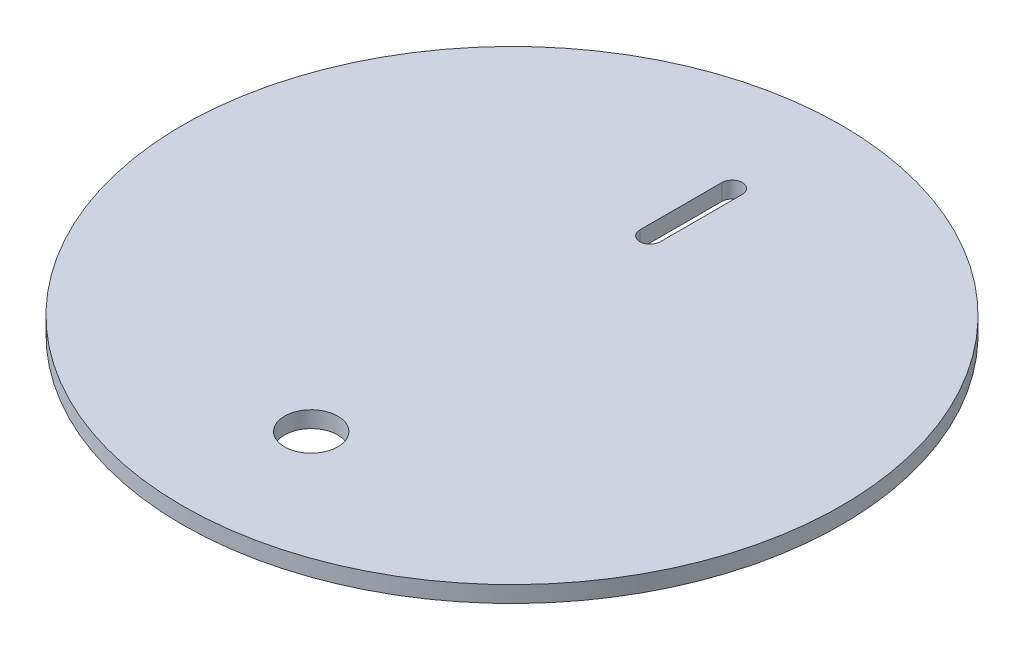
ISO-10303-21;
HEADER;
FILE_DESCRIPTION(('STEP AP214'),'2;1');
FILE_NAME('part.step','',(''),(''),'','','');
FILE_SCHEMA(('AUTOMOTIVE_DESIGN { 1 0 10303 214 1 1 1 1 }'));
ENDSEC;
DATA;
#1=APPLICATION_CONTEXT('core data for automotive mechanical design processes');
#2=APPLICATION_PROTOCOL_DEFINITION('international standard','automotive_design',2000,#1);
#3=PRODUCT_CONTEXT('',#1,'mechanical');
#4=PRODUCT('Part','Part','',(#3));
#5=PRODUCT_RELATED_PRODUCT_CATEGORY('part','',(#4));
#6=PRODUCT_DEFINITION_FORMATION('','',#4);
#7=PRODUCT_DEFINITION_CONTEXT('part definition',#1,'design');
#8=PRODUCT_DEFINITION('design','',#6,#7);
#9=PRODUCT_DEFINITION_SHAPE('','',#8);
#10=(LENGTH_UNIT() NAMED_UNIT(*) SI_UNIT(.MILLI.,.METRE.));
#11=(NAMED_UNIT(*) PLANE_ANGLE_UNIT() SI_UNIT($,.RADIAN.));
#12=(NAMED_UNIT(*) SI_UNIT($,.STERADIAN.) SOLID_ANGLE_UNIT());
#13=UNCERTAINTY_MEASURE_WITH_UNIT(LENGTH_MEASURE(1.E-05),#10,'distance_accuracy_value','');
#14=(GEOMETRIC_REPRESENTATION_CONTEXT(3) GLOBAL_UNCERTAINTY_ASSIGNED_CONTEXT((#13)) GLOBAL_UNIT_ASSIGNED_CONTEXT((#10,
#11,#12)) REPRESENTATION_CONTEXT('',''));
#15=CARTESIAN_POINT('',(0.,0.,0.));
#16=DIRECTION('',(0.,0.,1.));
#17=DIRECTION('',(1.,0.,0.));
#18=AXIS2_PLACEMENT_3D('',#15,#16,#17);
#19=CARTESIAN_POINT('',(0.,4.,0.));
#20=DIRECTION('',(0.,-1.,0.));
#21=DIRECTION('',(0.,0.,-1.));
#22=AXIS2_PLACEMENT_3D('',#19,#20,#21);
#23=CYLINDRICAL_SURFACE('',#22,80.4);
#24=CARTESIAN_POINT('',(0.,4.,0.));
#25=DIRECTION('',(0.,1.,0.));
#26=DIRECTION('',(0.,0.,1.));
#27=AXIS2_PLACEMENT_3D('',#24,#25,#26);
#28=CIRCLE('',#27,80.4);
#29=CARTESIAN_POINT('',(0.,4.,80.4));
#30=VERTEX_POINT('',#29);
#31=EDGE_CURVE('E11',#30,#30,#28,.T.);
#32=ORIENTED_EDGE('',*,*,#31,.F.);
#33=EDGE_LOOP('',(#32));
#34=FACE_BOUND('',#33,.T.);
#35=CARTESIAN_POINT('',(0.,0.,0.));
#36=DIRECTION('',(0.,1.,0.));
#37=DIRECTION('',(0.,0.,1.));
#38=AXIS2_PLACEMENT_3D('',#35,#36,#37);
#39=CIRCLE('',#38,80.4);
#40=CARTESIAN_POINT('',(0.,0.,80.4));
#41=VERTEX_POINT('',#40);
#42=EDGE_CURVE('E42',#41,#41,#39,.T.);
#43=ORIENTED_EDGE('',*,*,#42,.T.);
#44=EDGE_LOOP('',(#43));
#45=FACE_BOUND('',#44,.T.);
#46=ADVANCED_FACE('F39',(#34,#45),#23,.T.);
#47=CARTESIAN_POINT('',(0.,4.,0.));
#48=DIRECTION('',(0.,1.,0.));
#49=DIRECTION('',(0.,0.,1.));
#50=AXIS2_PLACEMENT_3D('',#47,#48,#49);
#51=PLANE('',#50);
#52=CARTESIAN_POINT('',(0.,4.,48.9860189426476));
#53=DIRECTION('',(0.,-1.,0.));
#54=DIRECTION('',(0.,0.,-1.));
#55=AXIS2_PLACEMENT_3D('',#52,#53,#54);
#56=CIRCLE('',#55,6.5);
#57=CARTESIAN_POINT('',(0.,4.,42.4860189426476));
#58=VERTEX_POINT('',#57);
#59=EDGE_CURVE('E159',#58,#58,#56,.T.);
#60=ORIENTED_EDGE('',*,*,#59,.T.);
#61=EDGE_LOOP('',(#60));
#62=FACE_BOUND('',#61,.T.);
#63=CARTESIAN_POINT('',(0.,4.,-33.7007744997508));
#64=DIRECTION('',(0.,-1.,0.));
#65=DIRECTION('',(0.,0.,-1.));
#66=AXIS2_PLACEMENT_3D('',#63,#64,#65);
#67=CIRCLE('',#66,2.5);
#68=CARTESIAN_POINT('',(2.50000000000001,4.,-33.7007744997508));
#69=VERTEX_POINT('',#68);
#70=CARTESIAN_POINT('',(-2.49999999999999,4.,-33.7007744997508));
#71=VERTEX_POINT('',#70);
#72=EDGE_CURVE('E82',#69,#71,#67,.T.);
#73=ORIENTED_EDGE('',*,*,#72,.T.);
#74=DIRECTION('',(0.,0.,-1.));
#75=VECTOR('',#74,1.);
#76=CARTESIAN_POINT('',(-2.49999999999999,4.,-33.7007744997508));
#77=LINE('',#76,#75);
#78=CARTESIAN_POINT('',(-2.49999999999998,4.,-53.7007744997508));
#79=VERTEX_POINT('',#78);
#80=EDGE_CURVE('E92',#71,#79,#77,.T.);
#81=ORIENTED_EDGE('',*,*,#80,.T.);
#82=CARTESIAN_POINT('',(0.,4.,-53.7007744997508));
#83=DIRECTION('',(0.,-1.,0.));
#84=DIRECTION('',(0.,0.,-1.));
#85=AXIS2_PLACEMENT_3D('',#82,#83,#84);
#86=CIRCLE('',#85,2.5);
#87=CARTESIAN_POINT('',(2.50000000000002,4.,-53.7007744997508));
#88=VERTEX_POINT('',#87);
#89=EDGE_CURVE('E54',#79,#88,#86,.T.);
#90=ORIENTED_EDGE('',*,*,#89,.T.);
#91=DIRECTION('',(0.,0.,1.));
#92=VECTOR('',#91,1.);
#93=CARTESIAN_POINT('',(2.50000000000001,4.,-33.7007744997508));
#94=LINE('',#93,#92);
#95=EDGE_CURVE('E89',#88,#69,#94,.T.);
#96=ORIENTED_EDGE('',*,*,#95,.T.);
#97=EDGE_LOOP('',(#73,#81,#90,#96));
#98=FACE_BOUND('',#97,.T.);
#99=ORIENTED_EDGE('',*,*,#31,.T.);
#100=EDGE_LOOP('',(#99));
#101=FACE_BOUND('',#100,.T.);
#102=ADVANCED_FACE('F97',(#62,#98,#101),#51,.T.);
#103=CARTESIAN_POINT('',(0.,0.,0.));
#104=DIRECTION('',(0.,1.,0.));
#105=DIRECTION('',(0.,0.,1.));
#106=AXIS2_PLACEMENT_3D('',#103,#104,#105);
#107=PLANE('',#106);
#108=CARTESIAN_POINT('',(0.,0.,48.9860189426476));
#109=DIRECTION('',(0.,-1.,0.));
#110=DIRECTION('',(0.,0.,-1.));
#111=AXIS2_PLACEMENT_3D('',#108,#109,#110);
#112=CIRCLE('',#111,6.5);
#113=CARTESIAN_POINT('',(0.,0.,42.4860189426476));
#114=VERTEX_POINT('',#113);
#115=EDGE_CURVE('E108',#114,#114,#112,.T.);
#116=ORIENTED_EDGE('',*,*,#115,.F.);
#117=EDGE_LOOP('',(#116));
#118=FACE_BOUND('',#117,.T.);
#119=DIRECTION('',(0.,0.,-1.));
#120=VECTOR('',#119,1.);
#121=CARTESIAN_POINT('',(-2.49999999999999,0.,-33.7007744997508));
#122=LINE('',#121,#120);
#123=CARTESIAN_POINT('',(-2.49999999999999,0.,-33.7007744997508));
#124=VERTEX_POINT('',#123);
#125=CARTESIAN_POINT('',(-2.5,0.,-53.7007744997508));
#126=VERTEX_POINT('',#125);
#127=EDGE_CURVE('E117',#124,#126,#122,.T.);
#128=ORIENTED_EDGE('',*,*,#127,.F.);
#129=CARTESIAN_POINT('',(0.,0.,-33.7007744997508));
#130=DIRECTION('',(0.,-1.,0.));
#131=DIRECTION('',(0.,0.,-1.));
#132=AXIS2_PLACEMENT_3D('',#129,#130,#131);
#133=CIRCLE('',#132,2.5);
#134=CARTESIAN_POINT('',(2.50000000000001,0.,-33.7007744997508));
#135=VERTEX_POINT('',#134);
#136=EDGE_CURVE('E62',#135,#124,#133,.T.);
#137=ORIENTED_EDGE('',*,*,#136,.F.);
#138=DIRECTION('',(0.,0.,1.));
#139=VECTOR('',#138,1.);
#140=CARTESIAN_POINT('',(2.50000000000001,0.,-33.7007744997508));
#141=LINE('',#140,#139);
#142=CARTESIAN_POINT('',(2.50000000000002,0.,-53.7007744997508));
#143=VERTEX_POINT('',#142);
#144=EDGE_CURVE('E101',#143,#135,#141,.T.);
#145=ORIENTED_EDGE('',*,*,#144,.F.);
#146=CARTESIAN_POINT('',(0.,0.,-53.7007744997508));
#147=DIRECTION('',(0.,-1.,0.));
#148=DIRECTION('',(0.,0.,-1.));
#149=AXIS2_PLACEMENT_3D('',#146,#147,#148);
#150=CIRCLE('',#149,2.5);
#151=EDGE_CURVE('E105',#126,#143,#150,.T.);
#152=ORIENTED_EDGE('',*,*,#151,.F.);
#153=EDGE_LOOP('',(#128,#137,#145,#152));
#154=FACE_BOUND('',#153,.T.);
#155=ORIENTED_EDGE('',*,*,#42,.F.);
#156=EDGE_LOOP('',(#155));
#157=FACE_BOUND('',#156,.T.);
#158=ADVANCED_FACE('F134',(#118,#154,#157),#107,.F.);
#159=CARTESIAN_POINT('',(0.,4.,-33.7007744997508));
#160=DIRECTION('',(0.,-1.,0.));
#161=DIRECTION('',(0.,0.,-1.));
#162=AXIS2_PLACEMENT_3D('',#159,#160,#161);
#163=CYLINDRICAL_SURFACE('',#162,2.5);
#164=ORIENTED_EDGE('',*,*,#136,.T.);
#165=DIRECTION('',(0.,-1.,0.));
#166=VECTOR('',#165,1.);
#167=CARTESIAN_POINT('',(-2.49999999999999,4.,-33.7007744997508));
#168=LINE('',#167,#166);
#169=EDGE_CURVE('E78',#71,#124,#168,.T.);
#170=ORIENTED_EDGE('',*,*,#169,.F.);
#171=ORIENTED_EDGE('',*,*,#72,.F.);
#172=DIRECTION('',(0.,-1.,0.));
#173=VECTOR('',#172,1.);
#174=CARTESIAN_POINT('',(2.50000000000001,4.,-33.7007744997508));
#175=LINE('',#174,#173);
#176=EDGE_CURVE('E123',#69,#135,#175,.T.);
#177=ORIENTED_EDGE('',*,*,#176,.T.);
#178=EDGE_LOOP('',(#164,#170,#171,#177));
#179=FACE_BOUND('',#178,.T.);
#180=ADVANCED_FACE('F80',(#179),#163,.F.);
#181=CARTESIAN_POINT('',(2.50000000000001,4.,-33.7007744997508));
#182=DIRECTION('',(1.,0.,0.));
#183=DIRECTION('',(0.,0.,-1.));
#184=AXIS2_PLACEMENT_3D('',#181,#182,#183);
#185=PLANE('',#184);
#186=ORIENTED_EDGE('',*,*,#144,.T.);
#187=ORIENTED_EDGE('',*,*,#176,.F.);
#188=ORIENTED_EDGE('',*,*,#95,.F.);
#189=DIRECTION('',(0.,-1.,0.));
#190=VECTOR('',#189,1.);
#191=CARTESIAN_POINT('',(2.50000000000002,4.,-53.7007744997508));
#192=LINE('',#191,#190);
#193=EDGE_CURVE('E126',#88,#143,#192,.T.);
#194=ORIENTED_EDGE('',*,*,#193,.T.);
#195=EDGE_LOOP('',(#186,#187,#188,#194));
#196=FACE_BOUND('',#195,.T.);
#197=ADVANCED_FACE('F137',(#196),#185,.F.);
#198=CARTESIAN_POINT('',(0.,4.,-53.7007744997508));
#199=DIRECTION('',(0.,-1.,0.));
#200=DIRECTION('',(0.,0.,-1.));
#201=AXIS2_PLACEMENT_3D('',#198,#199,#200);
#202=CYLINDRICAL_SURFACE('',#201,2.5);
#203=ORIENTED_EDGE('',*,*,#151,.T.);
#204=ORIENTED_EDGE('',*,*,#193,.F.);
#205=ORIENTED_EDGE('',*,*,#89,.F.);
#206=DIRECTION('',(0.,-1.,0.));
#207=VECTOR('',#206,1.);
#208=CARTESIAN_POINT('',(-2.5,4.,-53.7007744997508));
#209=LINE('',#208,#207);
#210=EDGE_CURVE('E88',#79,#126,#209,.T.);
#211=ORIENTED_EDGE('',*,*,#210,.T.);
#212=EDGE_LOOP('',(#203,#204,#205,#211));
#213=FACE_BOUND('',#212,.T.);
#214=ADVANCED_FACE('F130',(#213),#202,.F.);
#215=CARTESIAN_POINT('',(-2.49999999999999,4.,-33.7007744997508));
#216=DIRECTION('',(-1.,0.,0.));
#217=DIRECTION('',(0.,0.,1.));
#218=AXIS2_PLACEMENT_3D('',#215,#216,#217);
#219=PLANE('',#218);
#220=ORIENTED_EDGE('',*,*,#127,.T.);
#221=ORIENTED_EDGE('',*,*,#210,.F.);
#222=ORIENTED_EDGE('',*,*,#80,.F.);
#223=ORIENTED_EDGE('',*,*,#169,.T.);
#224=EDGE_LOOP('',(#220,#221,#222,#223));
#225=FACE_BOUND('',#224,.T.);
#226=ADVANCED_FACE('F93',(#225),#219,.F.);
#227=CARTESIAN_POINT('',(0.,4.,48.9860189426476));
#228=DIRECTION('',(0.,-1.,0.));
#229=DIRECTION('',(0.,0.,-1.));
#230=AXIS2_PLACEMENT_3D('',#227,#228,#229);
#231=CYLINDRICAL_SURFACE('',#230,6.5);
#232=ORIENTED_EDGE('',*,*,#59,.F.);
#233=EDGE_LOOP('',(#232));
#234=FACE_BOUND('',#233,.T.);
#235=ORIENTED_EDGE('',*,*,#115,.T.);
#236=EDGE_LOOP('',(#235));
#237=FACE_BOUND('',#236,.T.);
#238=ADVANCED_FACE('F167',(#234,#237),#231,.F.);
#239=CLOSED_SHELL('',(#46,#102,#158,#180,#197,#214,#226,#238));
#240=MANIFOLD_SOLID_BREP('B2',#239);
#241=ADVANCED_BREP_SHAPE_REPRESENTATION('',(#18,#240),#14);
#242=SHAPE_DEFINITION_REPRESENTATION(#9,#241);
ENDSEC;
END-ISO-10303-21;
